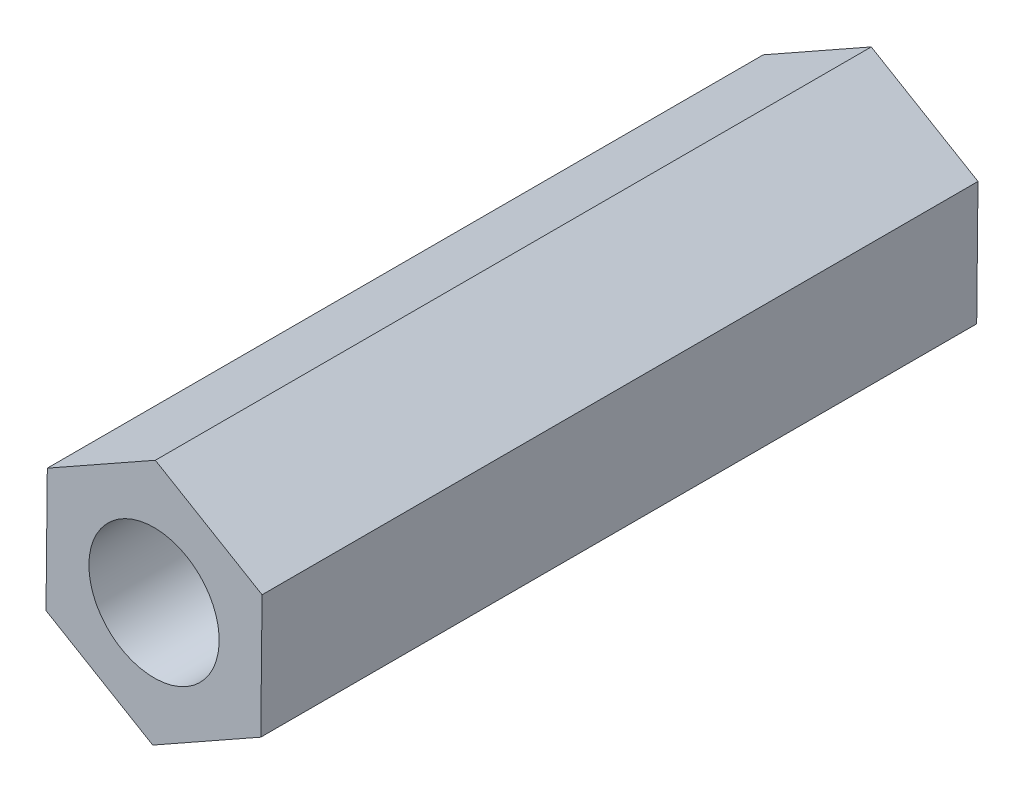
ISO-10303-21;
HEADER;
FILE_DESCRIPTION(('STEP AP214'),'2;1');
FILE_NAME('part.step','',(''),(''),'','','');
FILE_SCHEMA(('AUTOMOTIVE_DESIGN { 1 0 10303 214 1 1 1 1 }'));
ENDSEC;
DATA;
#1=APPLICATION_CONTEXT('core data for automotive mechanical design processes');
#2=APPLICATION_PROTOCOL_DEFINITION('international standard','automotive_design',2000,#1);
#3=PRODUCT_CONTEXT('',#1,'mechanical');
#4=PRODUCT('Part','Part','',(#3));
#5=PRODUCT_RELATED_PRODUCT_CATEGORY('part','',(#4));
#6=PRODUCT_DEFINITION_FORMATION('','',#4);
#7=PRODUCT_DEFINITION_CONTEXT('part definition',#1,'design');
#8=PRODUCT_DEFINITION('design','',#6,#7);
#9=PRODUCT_DEFINITION_SHAPE('','',#8);
#10=(LENGTH_UNIT() NAMED_UNIT(*) SI_UNIT(.MILLI.,.METRE.));
#11=(NAMED_UNIT(*) PLANE_ANGLE_UNIT() SI_UNIT($,.RADIAN.));
#12=(NAMED_UNIT(*) SI_UNIT($,.STERADIAN.) SOLID_ANGLE_UNIT());
#13=UNCERTAINTY_MEASURE_WITH_UNIT(LENGTH_MEASURE(1.E-05),#10,'distance_accuracy_value','');
#14=(GEOMETRIC_REPRESENTATION_CONTEXT(3) GLOBAL_UNCERTAINTY_ASSIGNED_CONTEXT((#13)) GLOBAL_UNIT_ASSIGNED_CONTEXT((#10,
#11,#12)) REPRESENTATION_CONTEXT('',''));
#15=CARTESIAN_POINT('',(0.,0.,0.));
#16=DIRECTION('',(0.,0.,1.));
#17=DIRECTION('',(1.,0.,0.));
#18=AXIS2_PLACEMENT_3D('',#15,#16,#17);
#19=CARTESIAN_POINT('',(0.,0.,60.));
#20=DIRECTION('',(0.,0.,-1.));
#21=DIRECTION('',(-1.,0.,0.));
#22=AXIS2_PLACEMENT_3D('',#19,#20,#21);
#23=CYLINDRICAL_SURFACE('',#22,13.);
#24=CARTESIAN_POINT('',(0.,0.,40.));
#25=DIRECTION('',(0.,0.,-1.));
#26=DIRECTION('',(-1.,0.,0.));
#27=AXIS2_PLACEMENT_3D('',#24,#25,#26);
#28=CIRCLE('',#27,13.);
#29=CARTESIAN_POINT('',(-13.,0.,40.));
#30=VERTEX_POINT('',#29);
#31=EDGE_CURVE('E130',#30,#30,#28,.T.);
#32=ORIENTED_EDGE('',*,*,#31,.T.);
#33=EDGE_LOOP('',(#32));
#34=FACE_BOUND('',#33,.T.);
#35=CARTESIAN_POINT('',(0.,0.,80.));
#36=DIRECTION('',(0.,0.,-1.));
#37=DIRECTION('',(-1.,0.,0.));
#38=AXIS2_PLACEMENT_3D('',#35,#36,#37);
#39=CIRCLE('',#38,13.);
#40=CARTESIAN_POINT('',(-13.,0.,80.));
#41=VERTEX_POINT('',#40);
#42=EDGE_CURVE('E20',#41,#41,#39,.T.);
#43=ORIENTED_EDGE('',*,*,#42,.F.);
#44=EDGE_LOOP('',(#43));
#45=FACE_BOUND('',#44,.T.);
#46=ADVANCED_FACE('F16',(#34,#45),#23,.F.);
#47=CARTESIAN_POINT('',(0.,0.,80.));
#48=DIRECTION('',(0.,0.,-1.));
#49=DIRECTION('',(-1.,0.,0.));
#50=AXIS2_PLACEMENT_3D('',#47,#48,#49);
#51=PLANE('',#50);
#52=CARTESIAN_POINT('',(0.,0.,80.));
#53=DIRECTION('',(0.,0.,-1.));
#54=DIRECTION('',(-1.,0.,0.));
#55=AXIS2_PLACEMENT_3D('',#52,#53,#54);
#56=CIRCLE('',#55,10.9175);
#57=CARTESIAN_POINT('',(-10.9175,0.,80.));
#58=VERTEX_POINT('',#57);
#59=EDGE_CURVE('E128',#58,#58,#56,.F.);
#60=ORIENTED_EDGE('',*,*,#59,.T.);
#61=EDGE_LOOP('',(#60));
#62=FACE_BOUND('',#61,.T.);
#63=ORIENTED_EDGE('',*,*,#42,.T.);
#64=EDGE_LOOP('',(#63));
#65=FACE_BOUND('',#64,.T.);
#66=ADVANCED_FACE('F137',(#62,#65),#51,.T.);
#67=CARTESIAN_POINT('',(0.,0.,40.));
#68=DIRECTION('',(0.,0.,-1.));
#69=DIRECTION('',(-1.,0.,0.));
#70=AXIS2_PLACEMENT_3D('',#67,#68,#69);
#71=PLANE('',#70);
#72=CARTESIAN_POINT('',(0.,0.,40.));
#73=DIRECTION('',(0.,0.,1.));
#74=DIRECTION('',(1.,0.,0.));
#75=AXIS2_PLACEMENT_3D('',#72,#73,#74);
#76=CIRCLE('',#75,10.9175);
#77=CARTESIAN_POINT('',(10.9175,0.,40.));
#78=VERTEX_POINT('',#77);
#79=EDGE_CURVE('E82',#78,#78,#76,.F.);
#80=ORIENTED_EDGE('',*,*,#79,.T.);
#81=EDGE_LOOP('',(#80));
#82=FACE_BOUND('',#81,.T.);
#83=ORIENTED_EDGE('',*,*,#31,.F.);
#84=EDGE_LOOP('',(#83));
#85=FACE_BOUND('',#84,.T.);
#86=ADVANCED_FACE('F144',(#82,#85),#71,.F.);
#87=CARTESIAN_POINT('',(0.,0.,120.));
#88=DIRECTION('',(0.,0.,-1.));
#89=DIRECTION('',(-1.,0.,0.));
#90=AXIS2_PLACEMENT_3D('',#87,#88,#89);
#91=CYLINDRICAL_SURFACE('',#90,10.9175);
#92=CARTESIAN_POINT('',(0.,0.,120.));
#93=DIRECTION('',(0.,0.,-1.));
#94=DIRECTION('',(-1.,0.,0.));
#95=AXIS2_PLACEMENT_3D('',#92,#93,#94);
#96=CIRCLE('',#95,10.9175);
#97=CARTESIAN_POINT('',(-10.9175,0.,120.));
#98=VERTEX_POINT('',#97);
#99=EDGE_CURVE('E90',#98,#98,#96,.T.);
#100=ORIENTED_EDGE('',*,*,#99,.F.);
#101=EDGE_LOOP('',(#100));
#102=FACE_BOUND('',#101,.T.);
#103=ORIENTED_EDGE('',*,*,#59,.F.);
#104=EDGE_LOOP('',(#103));
#105=FACE_BOUND('',#104,.T.);
#106=ADVANCED_FACE('F158',(#102,#105),#91,.F.);
#107=CARTESIAN_POINT('',(-18.1083306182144,-10.2023704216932,0.));
#108=DIRECTION('',(-0.999944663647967,0.01051996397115,0.));
#109=DIRECTION('',(-0.01051996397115,-0.999944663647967,0.));
#110=AXIS2_PLACEMENT_3D('',#107,#108,#109);
#111=PLANE('',#110);
#112=DIRECTION('',(-0.0105199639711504,-0.999944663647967,0.));
#113=VECTOR('',#112,1.);
#114=CARTESIAN_POINT('',(-17.8896772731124,10.5810891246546,0.));
#115=LINE('',#114,#113);
#116=CARTESIAN_POINT('',(-17.8896772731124,10.5810891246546,0.));
#117=VERTEX_POINT('',#116);
#118=CARTESIAN_POINT('',(-18.1083306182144,-10.2023704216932,0.));
#119=VERTEX_POINT('',#118);
#120=EDGE_CURVE('E109',#117,#119,#115,.T.);
#121=ORIENTED_EDGE('',*,*,#120,.T.);
#122=DIRECTION('',(0.,0.,1.));
#123=VECTOR('',#122,1.);
#124=CARTESIAN_POINT('',(-18.1083306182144,-10.2023704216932,0.));
#125=LINE('',#124,#123);
#126=CARTESIAN_POINT('',(-18.1083306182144,-10.2023704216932,120.));
#127=VERTEX_POINT('',#126);
#128=EDGE_CURVE('E88',#127,#119,#125,.F.);
#129=ORIENTED_EDGE('',*,*,#128,.F.);
#130=DIRECTION('',(-0.0105199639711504,-0.999944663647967,0.));
#131=VECTOR('',#130,1.);
#132=CARTESIAN_POINT('',(-17.8896772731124,10.5810891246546,120.));
#133=LINE('',#132,#131);
#134=CARTESIAN_POINT('',(-17.8896772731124,10.5810891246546,120.));
#135=VERTEX_POINT('',#134);
#136=EDGE_CURVE('E85',#135,#127,#133,.T.);
#137=ORIENTED_EDGE('',*,*,#136,.F.);
#138=DIRECTION('',(0.,0.,1.));
#139=VECTOR('',#138,1.);
#140=CARTESIAN_POINT('',(-17.8896772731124,10.5810891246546,0.));
#141=LINE('',#140,#139);
#142=EDGE_CURVE('E75',#117,#135,#141,.T.);
#143=ORIENTED_EDGE('',*,*,#142,.F.);
#144=EDGE_LOOP('',(#121,#129,#137,#143));
#145=FACE_BOUND('',#144,.T.);
#146=ADVANCED_FACE('F86',(#145),#111,.T.);
#147=CARTESIAN_POINT('',(-0.218653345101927,-20.7834595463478,0.));
#148=DIRECTION('',(-0.509082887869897,-0.86071749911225,0.));
#149=DIRECTION('',(0.86071749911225,-0.509082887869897,0.));
#150=AXIS2_PLACEMENT_3D('',#147,#148,#149);
#151=PLANE('',#150);
#152=DIRECTION('',(0.86071749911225,-0.509082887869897,0.));
#153=VECTOR('',#152,1.);
#154=CARTESIAN_POINT('',(-18.1083306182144,-10.2023704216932,0.));
#155=LINE('',#154,#153);
#156=CARTESIAN_POINT('',(-0.218653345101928,-20.7834595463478,0.));
#157=VERTEX_POINT('',#156);
#158=EDGE_CURVE('E107',#119,#157,#155,.T.);
#159=ORIENTED_EDGE('',*,*,#158,.T.);
#160=DIRECTION('',(0.,0.,1.));
#161=VECTOR('',#160,1.);
#162=CARTESIAN_POINT('',(-0.218653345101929,-20.7834595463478,0.));
#163=LINE('',#162,#161);
#164=CARTESIAN_POINT('',(-0.218653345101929,-20.7834595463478,120.));
#165=VERTEX_POINT('',#164);
#166=EDGE_CURVE('E98',#165,#157,#163,.F.);
#167=ORIENTED_EDGE('',*,*,#166,.F.);
#168=DIRECTION('',(0.86071749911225,-0.509082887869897,0.));
#169=VECTOR('',#168,1.);
#170=CARTESIAN_POINT('',(-18.1083306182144,-10.2023704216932,120.));
#171=LINE('',#170,#169);
#172=EDGE_CURVE('E81',#127,#165,#171,.T.);
#173=ORIENTED_EDGE('',*,*,#172,.F.);
#174=ORIENTED_EDGE('',*,*,#128,.T.);
#175=EDGE_LOOP('',(#159,#167,#173,#174));
#176=FACE_BOUND('',#175,.T.);
#177=ADVANCED_FACE('F163',(#176),#151,.T.);
#178=CARTESIAN_POINT('',(0.,0.,0.));
#179=DIRECTION('',(0.,0.,1.));
#180=DIRECTION('',(1.,0.,0.));
#181=AXIS2_PLACEMENT_3D('',#178,#179,#180);
#182=CYLINDRICAL_SURFACE('',#181,10.9175);
#183=ORIENTED_EDGE('',*,*,#79,.F.);
#184=EDGE_LOOP('',(#183));
#185=FACE_BOUND('',#184,.T.);
#186=CARTESIAN_POINT('',(0.,0.,0.));
#187=DIRECTION('',(0.,0.,1.));
#188=DIRECTION('',(1.,0.,0.));
#189=AXIS2_PLACEMENT_3D('',#186,#187,#188);
#190=CIRCLE('',#189,10.9175);
#191=CARTESIAN_POINT('',(10.9175,0.,0.));
#192=VERTEX_POINT('',#191);
#193=EDGE_CURVE('E106',#192,#192,#190,.F.);
#194=ORIENTED_EDGE('',*,*,#193,.T.);
#195=EDGE_LOOP('',(#194));
#196=FACE_BOUND('',#195,.T.);
#197=ADVANCED_FACE('F18',(#185,#196),#182,.F.);
#198=CARTESIAN_POINT('',(-17.8896772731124,10.5810891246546,0.));
#199=DIRECTION('',(-0.49086177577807,0.8712374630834,0.));
#200=DIRECTION('',(-0.8712374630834,-0.49086177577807,0.));
#201=AXIS2_PLACEMENT_3D('',#198,#199,#200);
#202=PLANE('',#201);
#203=DIRECTION('',(-0.8712374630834,-0.49086177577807,0.));
#204=VECTOR('',#203,1.);
#205=CARTESIAN_POINT('',(0.218653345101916,20.7834595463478,0.));
#206=LINE('',#205,#204);
#207=CARTESIAN_POINT('',(0.218653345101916,20.7834595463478,0.));
#208=VERTEX_POINT('',#207);
#209=EDGE_CURVE('E53',#208,#117,#206,.T.);
#210=ORIENTED_EDGE('',*,*,#209,.T.);
#211=ORIENTED_EDGE('',*,*,#142,.T.);
#212=DIRECTION('',(-0.8712374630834,-0.49086177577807,0.));
#213=VECTOR('',#212,1.);
#214=CARTESIAN_POINT('',(0.218653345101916,20.7834595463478,120.));
#215=LINE('',#214,#213);
#216=CARTESIAN_POINT('',(0.218653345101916,20.7834595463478,120.));
#217=VERTEX_POINT('',#216);
#218=EDGE_CURVE('E79',#217,#135,#215,.T.);
#219=ORIENTED_EDGE('',*,*,#218,.F.);
#220=DIRECTION('',(0.,0.,1.));
#221=VECTOR('',#220,1.);
#222=CARTESIAN_POINT('',(0.218653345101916,20.7834595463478,0.));
#223=LINE('',#222,#221);
#224=EDGE_CURVE('E112',#208,#217,#223,.T.);
#225=ORIENTED_EDGE('',*,*,#224,.F.);
#226=EDGE_LOOP('',(#210,#211,#219,#225));
#227=FACE_BOUND('',#226,.T.);
#228=ADVANCED_FACE('F77',(#227),#202,.T.);
#229=CARTESIAN_POINT('',(0.,0.,120.));
#230=DIRECTION('',(0.,0.,1.));
#231=DIRECTION('',(1.,0.,0.));
#232=AXIS2_PLACEMENT_3D('',#229,#230,#231);
#233=PLANE('',#232);
#234=ORIENTED_EDGE('',*,*,#99,.T.);
#235=EDGE_LOOP('',(#234));
#236=FACE_BOUND('',#235,.T.);
#237=ORIENTED_EDGE('',*,*,#218,.T.);
#238=ORIENTED_EDGE('',*,*,#136,.T.);
#239=ORIENTED_EDGE('',*,*,#172,.T.);
#240=DIRECTION('',(0.871237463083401,0.49086177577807,0.));
#241=VECTOR('',#240,1.);
#242=CARTESIAN_POINT('',(17.8896772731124,-10.5810891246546,120.));
#243=LINE('',#242,#241);
#244=CARTESIAN_POINT('',(17.8896772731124,-10.5810891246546,120.));
#245=VERTEX_POINT('',#244);
#246=EDGE_CURVE('E101',#245,#165,#243,.F.);
#247=ORIENTED_EDGE('',*,*,#246,.F.);
#248=DIRECTION('',(0.010519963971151,0.999944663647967,0.));
#249=VECTOR('',#248,1.);
#250=CARTESIAN_POINT('',(18.1083306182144,10.2023704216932,120.));
#251=LINE('',#250,#249);
#252=CARTESIAN_POINT('',(18.1083306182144,10.2023704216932,120.));
#253=VERTEX_POINT('',#252);
#254=EDGE_CURVE('E49',#253,#245,#251,.F.);
#255=ORIENTED_EDGE('',*,*,#254,.F.);
#256=DIRECTION('',(-0.86071749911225,0.509082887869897,0.));
#257=VECTOR('',#256,1.);
#258=CARTESIAN_POINT('',(0.218653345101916,20.7834595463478,120.));
#259=LINE('',#258,#257);
#260=EDGE_CURVE('E93',#217,#253,#259,.F.);
#261=ORIENTED_EDGE('',*,*,#260,.F.);
#262=EDGE_LOOP('',(#237,#238,#239,#247,#255,#261));
#263=FACE_BOUND('',#262,.T.);
#264=ADVANCED_FACE('F92',(#236,#263),#233,.T.);
#265=CARTESIAN_POINT('',(17.8896772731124,-10.5810891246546,0.));
#266=DIRECTION('',(0.49086177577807,-0.871237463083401,0.));
#267=DIRECTION('',(0.871237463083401,0.49086177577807,0.));
#268=AXIS2_PLACEMENT_3D('',#265,#266,#267);
#269=PLANE('',#268);
#270=DIRECTION('',(0.871237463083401,0.49086177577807,0.));
#271=VECTOR('',#270,1.);
#272=CARTESIAN_POINT('',(-0.218653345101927,-20.7834595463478,0.));
#273=LINE('',#272,#271);
#274=CARTESIAN_POINT('',(17.8896772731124,-10.5810891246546,0.));
#275=VERTEX_POINT('',#274);
#276=EDGE_CURVE('E104',#157,#275,#273,.T.);
#277=ORIENTED_EDGE('',*,*,#276,.T.);
#278=DIRECTION('',(0.,0.,1.));
#279=VECTOR('',#278,1.);
#280=CARTESIAN_POINT('',(17.8896772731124,-10.5810891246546,0.));
#281=LINE('',#280,#279);
#282=EDGE_CURVE('E118',#245,#275,#281,.F.);
#283=ORIENTED_EDGE('',*,*,#282,.F.);
#284=ORIENTED_EDGE('',*,*,#246,.T.);
#285=ORIENTED_EDGE('',*,*,#166,.T.);
#286=EDGE_LOOP('',(#277,#283,#284,#285));
#287=FACE_BOUND('',#286,.T.);
#288=ADVANCED_FACE('F173',(#287),#269,.T.);
#289=CARTESIAN_POINT('',(0.,0.,0.));
#290=DIRECTION('',(0.,0.,1.));
#291=DIRECTION('',(1.,0.,0.));
#292=AXIS2_PLACEMENT_3D('',#289,#290,#291);
#293=PLANE('',#292);
#294=ORIENTED_EDGE('',*,*,#193,.F.);
#295=EDGE_LOOP('',(#294));
#296=FACE_BOUND('',#295,.T.);
#297=ORIENTED_EDGE('',*,*,#158,.F.);
#298=ORIENTED_EDGE('',*,*,#120,.F.);
#299=ORIENTED_EDGE('',*,*,#209,.F.);
#300=DIRECTION('',(-0.86071749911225,0.509082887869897,0.));
#301=VECTOR('',#300,1.);
#302=CARTESIAN_POINT('',(0.218653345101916,20.7834595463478,0.));
#303=LINE('',#302,#301);
#304=CARTESIAN_POINT('',(18.1083306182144,10.2023704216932,0.));
#305=VERTEX_POINT('',#304);
#306=EDGE_CURVE('E35',#305,#208,#303,.T.);
#307=ORIENTED_EDGE('',*,*,#306,.F.);
#308=DIRECTION('',(0.010519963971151,0.999944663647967,0.));
#309=VECTOR('',#308,1.);
#310=CARTESIAN_POINT('',(18.1083306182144,10.2023704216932,0.));
#311=LINE('',#310,#309);
#312=EDGE_CURVE('E26',#275,#305,#311,.T.);
#313=ORIENTED_EDGE('',*,*,#312,.F.);
#314=ORIENTED_EDGE('',*,*,#276,.F.);
#315=EDGE_LOOP('',(#297,#298,#299,#307,#313,#314));
#316=FACE_BOUND('',#315,.T.);
#317=ADVANCED_FACE('F154',(#296,#316),#293,.F.);
#318=CARTESIAN_POINT('',(0.218653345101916,20.7834595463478,0.));
#319=DIRECTION('',(0.509082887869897,0.86071749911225,0.));
#320=DIRECTION('',(-0.86071749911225,0.509082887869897,0.));
#321=AXIS2_PLACEMENT_3D('',#318,#319,#320);
#322=PLANE('',#321);
#323=ORIENTED_EDGE('',*,*,#306,.T.);
#324=ORIENTED_EDGE('',*,*,#224,.T.);
#325=ORIENTED_EDGE('',*,*,#260,.T.);
#326=DIRECTION('',(0.,0.,1.));
#327=VECTOR('',#326,1.);
#328=CARTESIAN_POINT('',(18.1083306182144,10.2023704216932,0.));
#329=LINE('',#328,#327);
#330=EDGE_CURVE('E10',#305,#253,#329,.T.);
#331=ORIENTED_EDGE('',*,*,#330,.F.);
#332=EDGE_LOOP('',(#323,#324,#325,#331));
#333=FACE_BOUND('',#332,.T.);
#334=ADVANCED_FACE('F149',(#333),#322,.T.);
#335=CARTESIAN_POINT('',(18.1083306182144,10.2023704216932,0.));
#336=DIRECTION('',(0.999944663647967,-0.010519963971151,0.));
#337=DIRECTION('',(0.010519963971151,0.999944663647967,0.));
#338=AXIS2_PLACEMENT_3D('',#335,#336,#337);
#339=PLANE('',#338);
#340=ORIENTED_EDGE('',*,*,#312,.T.);
#341=ORIENTED_EDGE('',*,*,#330,.T.);
#342=ORIENTED_EDGE('',*,*,#254,.T.);
#343=ORIENTED_EDGE('',*,*,#282,.T.);
#344=EDGE_LOOP('',(#340,#341,#342,#343));
#345=FACE_BOUND('',#344,.T.);
#346=ADVANCED_FACE('F147',(#345),#339,.T.);
#347=CLOSED_SHELL('',(#46,#66,#86,#106,#146,#177,#197,#228,#264,#288,#317,#334,#346));
#348=MANIFOLD_SOLID_BREP('B1',#347);
#349=ADVANCED_BREP_SHAPE_REPRESENTATION('',(#18,#348),#14);
#350=SHAPE_DEFINITION_REPRESENTATION(#9,#349);
ENDSEC;
END-ISO-10303-21;
